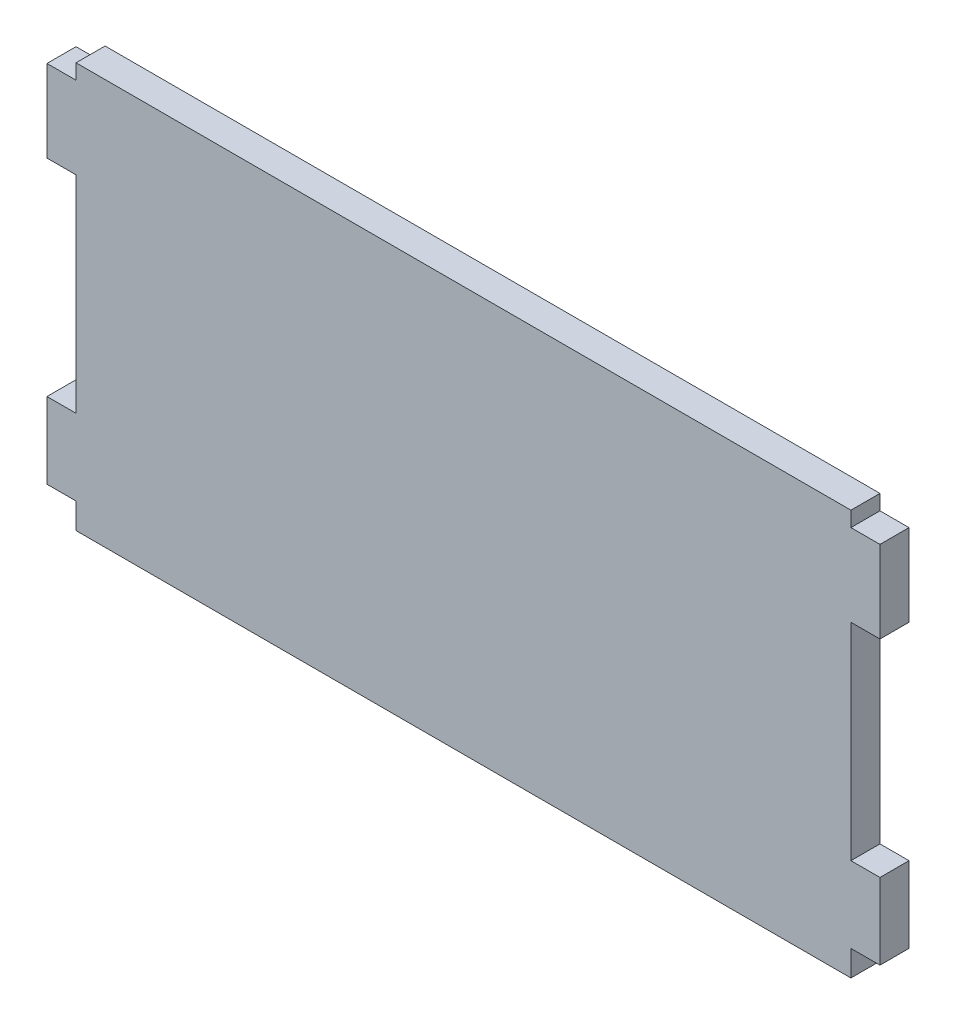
from build123d import *

# Parameters (mm, degrees)
ESQUISSE1_W        = 80
ESQUISSE1_H        = 41.829492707
BOSS_EXTRU_1_DEPTH = 3
ESQUISSE2_W        = 3
ESQUISSE2_H        = 8.462988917
ESQUISSE2_H_2      = 7.844205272
BOSS_EXTRU_2_DEPTH = 3


with BuildPart() as part:
    # Esquisse1 → Boss.-Extru.1 (new body)
    with BuildSketch(Plane.XY):
        with Locations((40, -6.893338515)):
            Rectangle(ESQUISSE1_W, ESQUISSE1_H)
    extrude(amount=BOSS_EXTRU_1_DEPTH)

    # Esquisse2 → Boss.-Extru.2 (add)
    with BuildSketch(Plane.XY.offset(3)):
        with Locations((-1.5, 8.230455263)):
            Rectangle(ESQUISSE2_W, ESQUISSE2_H)
        with Locations((-1.5, -21.240207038)):
            Rectangle(ESQUISSE2_W, ESQUISSE2_H_2)
        with Locations((81.5, 8.230455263)):
            Rectangle(ESQUISSE2_W, ESQUISSE2_H)
        with Locations((81.5, -21.240207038)):
            Rectangle(ESQUISSE2_W, ESQUISSE2_H_2)
    extrude(amount=-BOSS_EXTRU_2_DEPTH)


solid = part.part
